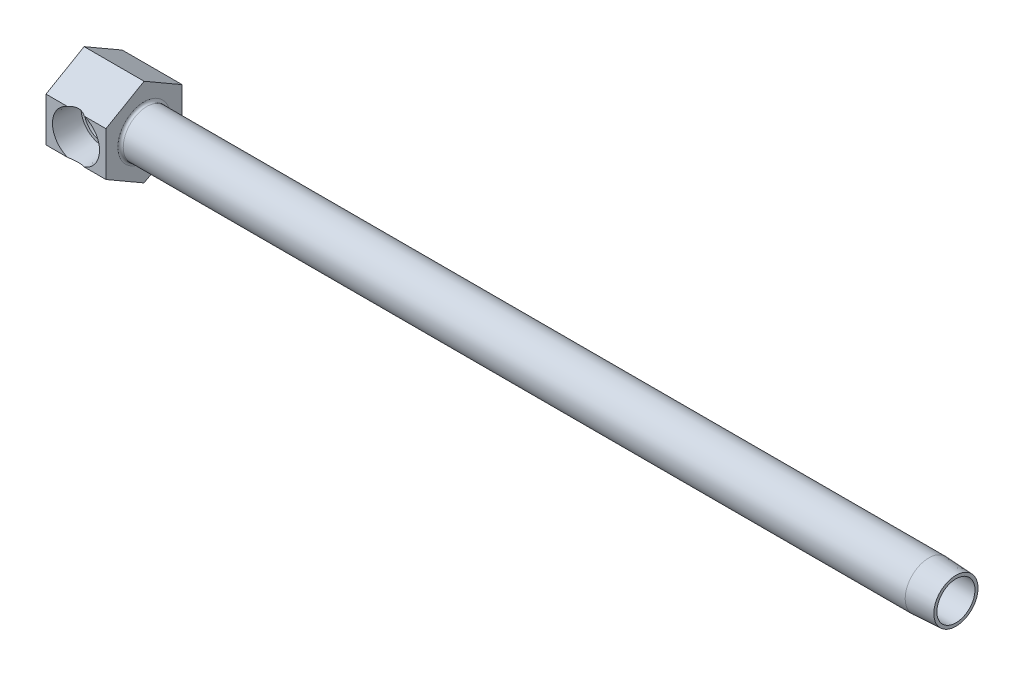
ISO-10303-21;
HEADER;
FILE_DESCRIPTION(('STEP AP214'),'2;1');
FILE_NAME('part.step','',(''),(''),'','','');
FILE_SCHEMA(('AUTOMOTIVE_DESIGN { 1 0 10303 214 1 1 1 1 }'));
ENDSEC;
DATA;
#1=APPLICATION_CONTEXT('core data for automotive mechanical design processes');
#2=APPLICATION_PROTOCOL_DEFINITION('international standard','automotive_design',2000,#1);
#3=PRODUCT_CONTEXT('',#1,'mechanical');
#4=PRODUCT('Part','Part','',(#3));
#5=PRODUCT_RELATED_PRODUCT_CATEGORY('part','',(#4));
#6=PRODUCT_DEFINITION_FORMATION('','',#4);
#7=PRODUCT_DEFINITION_CONTEXT('part definition',#1,'design');
#8=PRODUCT_DEFINITION('design','',#6,#7);
#9=PRODUCT_DEFINITION_SHAPE('','',#8);
#10=(LENGTH_UNIT() NAMED_UNIT(*) SI_UNIT(.MILLI.,.METRE.));
#11=(NAMED_UNIT(*) PLANE_ANGLE_UNIT() SI_UNIT($,.RADIAN.));
#12=(NAMED_UNIT(*) SI_UNIT($,.STERADIAN.) SOLID_ANGLE_UNIT());
#13=UNCERTAINTY_MEASURE_WITH_UNIT(LENGTH_MEASURE(1.E-05),#10,'distance_accuracy_value','');
#14=(GEOMETRIC_REPRESENTATION_CONTEXT(3) GLOBAL_UNCERTAINTY_ASSIGNED_CONTEXT((#13)) GLOBAL_UNIT_ASSIGNED_CONTEXT((#10,
#11,#12)) REPRESENTATION_CONTEXT('',''));
#15=CARTESIAN_POINT('',(0.,0.,0.));
#16=DIRECTION('',(0.,0.,1.));
#17=DIRECTION('',(1.,0.,0.));
#18=AXIS2_PLACEMENT_3D('',#15,#16,#17);
#19=CARTESIAN_POINT('',(8.7376,0.,22.225));
#20=DIRECTION('',(0.,0.,1.));
#21=DIRECTION('',(1.,0.,0.));
#22=AXIS2_PLACEMENT_3D('',#19,#20,#21);
#23=CONICAL_SURFACE('',#22,6.858,0.0523598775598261);
#24=CARTESIAN_POINT('',(8.7376,-0.680996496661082,34.5170205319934));
#25=DIRECTION('',(0.,-0.866025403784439,-0.5));
#26=DIRECTION('',(0.,-0.5,0.866025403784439));
#27=AXIS2_PLACEMENT_3D('',#24,#25,#26);
#28=ELLIPSE('',#27,15.0043949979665,7.47122554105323);
#29=CARTESIAN_POINT('',(11.1603281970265,6.4158048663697,22.225));
#30=VERTEX_POINT('',#29);
#31=CARTESIAN_POINT('',(6.3148718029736,6.4158048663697,22.225));
#32=VERTEX_POINT('',#31);
#33=EDGE_CURVE('E180',#30,#32,#28,.F.);
#34=ORIENTED_EDGE('',*,*,#33,.T.);
#35=CARTESIAN_POINT('',(8.7376,0.,22.225));
#36=DIRECTION('',(0.,0.,-1.));
#37=DIRECTION('',(-1.,0.,0.));
#38=AXIS2_PLACEMENT_3D('',#35,#36,#37);
#39=CIRCLE('',#38,6.858);
#40=CARTESIAN_POINT('',(6.31487180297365,-6.41580486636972,22.225));
#41=VERTEX_POINT('',#40);
#42=EDGE_CURVE('E38',#41,#32,#39,.T.);
#43=ORIENTED_EDGE('',*,*,#42,.F.);
#44=CARTESIAN_POINT('',(8.7376,0.680996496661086,34.5170205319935));
#45=DIRECTION('',(0.,0.866025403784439,-0.5));
#46=DIRECTION('',(0.,0.5,0.866025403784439));
#47=AXIS2_PLACEMENT_3D('',#44,#45,#46);
#48=ELLIPSE('',#47,15.0043949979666,7.47122554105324);
#49=CARTESIAN_POINT('',(11.1603281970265,-6.4158048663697,22.225));
#50=VERTEX_POINT('',#49);
#51=EDGE_CURVE('E23',#41,#50,#48,.F.);
#52=ORIENTED_EDGE('',*,*,#51,.T.);
#53=EDGE_CURVE('E174',#30,#50,#39,.T.);
#54=ORIENTED_EDGE('',*,*,#53,.F.);
#55=EDGE_LOOP('',(#34,#43,#52,#54));
#56=FACE_BOUND('',#55,.T.);
#57=CARTESIAN_POINT('',(8.7376,0.,14.3002));
#58=DIRECTION('',(0.,0.,-1.));
#59=DIRECTION('',(-1.,0.,0.));
#60=AXIS2_PLACEMENT_3D('',#57,#58,#59);
#61=CIRCLE('',#60,6.44267883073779);
#62=CARTESIAN_POINT('',(13.3057672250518,-4.54312213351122,14.3002));
#63=VERTEX_POINT('',#62);
#64=CARTESIAN_POINT('',(13.3057672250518,4.54312213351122,14.3002));
#65=VERTEX_POINT('',#64);
#66=EDGE_CURVE('E172',#63,#65,#61,.T.);
#67=ORIENTED_EDGE('',*,*,#66,.T.);
#68=CARTESIAN_POINT('',(13.3056128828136,4.54326245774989,14.3));
#69=CARTESIAN_POINT('',(13.4050037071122,4.45290836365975,14.4287190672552));
#70=CARTESIAN_POINT('',(13.5038252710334,4.35690222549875,14.5539811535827));
#71=CARTESIAN_POINT('',(13.6989301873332,4.15324987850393,14.7972290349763));
#72=CARTESIAN_POINT('',(13.7952093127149,4.04558563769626,14.9152031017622));
#73=CARTESIAN_POINT('',(13.9843700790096,3.81752411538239,15.1441485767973));
#74=CARTESIAN_POINT('',(14.0772125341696,3.69701926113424,15.25504596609));
#75=CARTESIAN_POINT('',(14.2568464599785,3.44414434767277,15.4675620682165));
#76=CARTESIAN_POINT('',(14.3436418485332,3.31178210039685,15.5691868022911));
#77=CARTESIAN_POINT('',(14.5527686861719,2.962976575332,15.8122617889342));
#78=CARTESIAN_POINT('',(14.6701286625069,2.73858307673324,15.9469651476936));
#79=CARTESIAN_POINT('',(14.8276174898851,2.38307262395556,16.1264780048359));
#80=CARTESIAN_POINT('',(14.8769849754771,2.26153631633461,16.1825173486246));
#81=CARTESIAN_POINT('',(14.9687772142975,2.0125151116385,16.2864098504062));
#82=CARTESIAN_POINT('',(15.0112056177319,1.88503338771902,16.3342673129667));
#83=CARTESIAN_POINT('',(15.088733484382,1.62324870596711,16.4215218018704));
#84=CARTESIAN_POINT('',(15.1237419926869,1.48888366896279,16.4608139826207));
#85=CARTESIAN_POINT('',(15.1849785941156,1.21573970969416,16.5294343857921));
#86=CARTESIAN_POINT('',(15.2112114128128,1.0769632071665,16.5587679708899));
#87=CARTESIAN_POINT('',(15.2542466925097,0.796159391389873,16.6068431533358));
#88=CARTESIAN_POINT('',(15.2710505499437,0.654132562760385,16.6255863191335));
#89=CARTESIAN_POINT('',(15.2947665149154,0.368243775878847,16.6520290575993));
#90=CARTESIAN_POINT('',(15.3016803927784,0.224382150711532,16.6597306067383));
#91=CARTESIAN_POINT('',(15.3051381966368,-0.0413792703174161,16.6635827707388));
#92=CARTESIAN_POINT('',(15.3031178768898,-0.163241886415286,16.6613326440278));
#93=CARTESIAN_POINT('',(15.2919140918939,-0.406265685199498,16.6488476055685));
#94=CARTESIAN_POINT('',(15.282728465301,-0.527426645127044,16.6386102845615));
#95=CARTESIAN_POINT('',(15.2573805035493,-0.768029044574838,16.6103343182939));
#96=CARTESIAN_POINT('',(15.2412218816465,-0.887471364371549,16.5922998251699));
#97=CARTESIAN_POINT('',(15.2022471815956,-1.1238947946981,16.5487418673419));
#98=CARTESIAN_POINT('',(15.1794285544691,-1.24087494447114,16.5232155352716));
#99=CARTESIAN_POINT('',(15.1030013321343,-1.58064044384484,16.4375716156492));
#100=CARTESIAN_POINT('',(15.0406598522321,-1.79907617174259,16.3675454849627));
#101=CARTESIAN_POINT('',(14.8959772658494,-2.2198653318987,16.2041288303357));
#102=CARTESIAN_POINT('',(14.8136249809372,-2.42220969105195,16.1107252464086));
#103=CARTESIAN_POINT('',(14.6581620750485,-2.75475802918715,15.9330467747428));
#104=CARTESIAN_POINT('',(14.588877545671,-2.88934500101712,15.8534887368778));
#105=CARTESIAN_POINT('',(14.4433958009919,-3.14876465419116,15.6853070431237));
#106=CARTESIAN_POINT('',(14.3671982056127,-3.27359679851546,15.5966828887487));
#107=CARTESIAN_POINT('',(14.2091096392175,-3.51355050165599,15.4112660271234));
#108=CARTESIAN_POINT('',(14.1272094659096,-3.62865566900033,15.3144600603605));
#109=CARTESIAN_POINT('',(13.9591121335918,-3.84892561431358,15.1136697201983));
#110=CARTESIAN_POINT('',(13.8729164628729,-3.95409379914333,15.0096878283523));
#111=CARTESIAN_POINT('',(13.7069469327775,-4.14374167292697,14.8068120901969));
#112=CARTESIAN_POINT('',(13.62749258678,-4.22922772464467,14.7085925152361));
#113=CARTESIAN_POINT('',(13.4673498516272,-4.39212627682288,14.5076746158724));
#114=CARTESIAN_POINT('',(13.386669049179,-4.46957495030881,14.4049995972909));
#115=CARTESIAN_POINT('',(13.3056128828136,-4.54326245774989,14.3));
#116=B_SPLINE_CURVE_WITH_KNOTS('',3,(#68,#69,#70,#71,#72,#73,#74,#75,#76,#77,#78,#79,#80,#81,
#82,#83,#84,#85,#86,#87,#88,#89,#90,#91,#92,#93,#94,#95,#96,#97,#98,#99,#100,#101,#102,#103,
#104,#105,#106,#107,#108,#109,#110,#111,#112,#113,#114,#115),.UNSPECIFIED.,.F.,.F.,(4,2,2,2,2,2,
2,2,2,2,2,2,2,2,2,2,2,2,2,2,2,2,2,4),(0.,0.558072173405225,1.11702021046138,1.68108674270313,
2.24478434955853,3.1014063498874,3.52893103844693,3.95623010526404,4.38849766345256,
4.82053207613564,5.25250248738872,5.68439556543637,6.04963287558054,6.41498039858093,
6.7801336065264,7.14542675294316,7.85550743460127,8.56598569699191,9.07835413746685,
9.59075076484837,10.1039943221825,10.6170612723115,11.0743952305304,11.5295724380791),.UNSPECIFIED.);
#117=EDGE_CURVE('E131',#65,#63,#116,.T.);
#118=ORIENTED_EDGE('',*,*,#117,.T.);
#119=EDGE_LOOP('',(#67,#118));
#120=FACE_BOUND('',#119,.T.);
#121=ADVANCED_FACE('F15',(#56,#120),#23,.F.);
#122=CARTESIAN_POINT('',(15.1802788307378,0.,14.3002));
#123=DIRECTION('',(0.,0.,1.));
#124=DIRECTION('',(1.,0.,0.));
#125=AXIS2_PLACEMENT_3D('',#122,#123,#124);
#126=PLANE('',#125);
#127=ORIENTED_EDGE('',*,*,#66,.F.);
#128=DIRECTION('',(1.,0.,0.));
#129=VECTOR('',#128,1.);
#130=CARTESIAN_POINT('',(65.6255637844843,-4.54312213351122,14.3002));
#131=LINE('',#130,#129);
#132=CARTESIAN_POINT('',(11.9253,-4.54312213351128,14.3002));
#133=VERTEX_POINT('',#132);
#134=EDGE_CURVE('E129',#63,#133,#131,.F.);
#135=ORIENTED_EDGE('',*,*,#134,.T.);
#136=CARTESIAN_POINT('',(8.7376,0.,14.3002));
#137=DIRECTION('',(0.,0.,-1.));
#138=DIRECTION('',(-1.,0.,0.));
#139=AXIS2_PLACEMENT_3D('',#136,#137,#138);
#140=CIRCLE('',#139,5.5499);
#141=CARTESIAN_POINT('',(11.9253,4.54312213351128,14.3002));
#142=VERTEX_POINT('',#141);
#143=EDGE_CURVE('E121',#133,#142,#140,.T.);
#144=ORIENTED_EDGE('',*,*,#143,.T.);
#145=DIRECTION('',(1.,0.,0.));
#146=VECTOR('',#145,1.);
#147=CARTESIAN_POINT('',(65.6255637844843,4.54312213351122,14.3002));
#148=LINE('',#147,#146);
#149=EDGE_CURVE('E124',#142,#65,#148,.T.);
#150=ORIENTED_EDGE('',*,*,#149,.T.);
#151=EDGE_LOOP('',(#127,#135,#144,#150));
#152=FACE_BOUND('',#151,.T.);
#153=ADVANCED_FACE('F162',(#152),#126,.T.);
#154=CARTESIAN_POINT('',(8.7376,0.,27.6280516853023));
#155=DIRECTION('',(0.,0.,-1.));
#156=DIRECTION('',(-1.,0.,0.));
#157=AXIS2_PLACEMENT_3D('',#154,#155,#156);
#158=CYLINDRICAL_SURFACE('',#157,5.5499);
#159=ORIENTED_EDGE('',*,*,#143,.F.);
#160=CARTESIAN_POINT('',(8.7376,0.,11.1125));
#161=DIRECTION('',(0.707106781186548,0.,-0.707106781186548));
#162=DIRECTION('',(-0.707106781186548,0.,-0.707106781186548));
#163=AXIS2_PLACEMENT_3D('',#160,#161,#162);
#164=ELLIPSE('',#163,7.84874384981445,5.5499);
#165=CARTESIAN_POINT('',(8.7376,-5.5499,11.1125));
#166=VERTEX_POINT('',#165);
#167=EDGE_CURVE('E110',#133,#166,#164,.T.);
#168=ORIENTED_EDGE('',*,*,#167,.T.);
#169=CARTESIAN_POINT('',(8.7376,0.,11.1125));
#170=DIRECTION('',(-0.707106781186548,0.,-0.707106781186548));
#171=DIRECTION('',(0.707106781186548,0.,-0.707106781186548));
#172=AXIS2_PLACEMENT_3D('',#169,#170,#171);
#173=ELLIPSE('',#172,7.84874384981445,5.5499);
#174=CARTESIAN_POINT('',(13.4708637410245,-2.89786203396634,6.37923625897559));
#175=VERTEX_POINT('',#174);
#176=EDGE_CURVE('E106',#166,#175,#173,.F.);
#177=ORIENTED_EDGE('',*,*,#176,.T.);
#178=CARTESIAN_POINT('',(8.7376,0.,6.37923625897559));
#179=DIRECTION('',(0.,0.,-1.));
#180=DIRECTION('',(-1.,0.,0.));
#181=AXIS2_PLACEMENT_3D('',#178,#179,#180);
#182=CIRCLE('',#181,5.5499);
#183=CARTESIAN_POINT('',(13.4708637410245,2.89786203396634,6.37923625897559));
#184=VERTEX_POINT('',#183);
#185=EDGE_CURVE('E177',#175,#184,#182,.T.);
#186=ORIENTED_EDGE('',*,*,#185,.T.);
#187=CARTESIAN_POINT('',(8.7376,5.5499,11.1125));
#188=VERTEX_POINT('',#187);
#189=EDGE_CURVE('E30',#184,#188,#173,.F.);
#190=ORIENTED_EDGE('',*,*,#189,.T.);
#191=EDGE_CURVE('E122',#188,#142,#164,.T.);
#192=ORIENTED_EDGE('',*,*,#191,.T.);
#193=EDGE_LOOP('',(#159,#168,#177,#186,#190,#192));
#194=FACE_BOUND('',#193,.T.);
#195=ADVANCED_FACE('F118',(#194),#158,.F.);
#196=CARTESIAN_POINT('',(8.7376,0.,6.37923625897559));
#197=DIRECTION('',(0.,0.,1.));
#198=DIRECTION('',(1.,0.,0.));
#199=AXIS2_PLACEMENT_3D('',#196,#197,#198);
#200=CONICAL_SURFACE('',#199,5.5499,1.04719755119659);
#201=CARTESIAN_POINT('',(8.7376,0.,3.175));
#202=VERTEX_POINT('',#201);
#203=VERTEX_LOOP('',#202);
#204=FACE_BOUND('',#203,.T.);
#205=ORIENTED_EDGE('',*,*,#185,.F.);
#206=CARTESIAN_POINT('',(13.4710699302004,-2.89818868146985,6.37943625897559));
#207=CARTESIAN_POINT('',(13.420685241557,-2.8185279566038,6.33063423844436));
#208=CARTESIAN_POINT('',(13.3737513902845,-2.73601453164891,6.28289768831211));
#209=CARTESIAN_POINT('',(13.2869939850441,-2.56583570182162,6.19038737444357));
#210=CARTESIAN_POINT('',(13.2471660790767,-2.47817349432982,6.14561180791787));
#211=CARTESIAN_POINT('',(13.1751547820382,-2.29911606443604,6.06025322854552));
#212=CARTESIAN_POINT('',(13.1428940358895,-2.20777091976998,6.01963042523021));
#213=CARTESIAN_POINT('',(13.0851463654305,-2.02119544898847,5.94274790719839));
#214=CARTESIAN_POINT('',(13.0596596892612,-1.92596498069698,5.90648835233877));
#215=CARTESIAN_POINT('',(13.0148514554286,-1.73255643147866,5.83897057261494));
#216=CARTESIAN_POINT('',(12.9955185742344,-1.63438413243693,5.80770321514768));
#217=CARTESIAN_POINT('',(12.9620830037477,-1.4356334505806,5.75050007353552));
#218=CARTESIAN_POINT('',(12.9479806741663,-1.33505490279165,5.72456465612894));
#219=CARTESIAN_POINT('',(12.9240526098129,-1.13183172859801,5.67823452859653));
#220=CARTESIAN_POINT('',(12.9142392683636,-1.02918199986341,5.65785593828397));
#221=CARTESIAN_POINT('',(12.8981074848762,-0.822623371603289,5.62290462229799));
#222=CARTESIAN_POINT('',(12.891789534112,-0.718714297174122,5.60833271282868));
#223=CARTESIAN_POINT('',(12.8810293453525,-0.489671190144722,5.58281999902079));
#224=CARTESIAN_POINT('',(12.8771967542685,-0.364365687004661,5.57314917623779));
#225=CARTESIAN_POINT('',(12.8729275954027,-0.113319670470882,5.56233429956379));
#226=CARTESIAN_POINT('',(12.8724915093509,0.0124209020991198,5.56119145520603));
#227=CARTESIAN_POINT('',(12.874939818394,0.263686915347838,5.567443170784));
#228=CARTESIAN_POINT('',(12.8778249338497,0.38921230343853,5.57483958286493));
#229=CARTESIAN_POINT('',(12.8874191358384,0.639322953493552,5.59811647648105));
#230=CARTESIAN_POINT('',(12.8941278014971,0.763908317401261,5.61399602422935));
#231=CARTESIAN_POINT('',(12.9116197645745,1.00072761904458,5.65236645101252));
#232=CARTESIAN_POINT('',(12.9220027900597,1.11310193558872,5.67417088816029));
#233=CARTESIAN_POINT('',(12.9479188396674,1.33574469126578,5.72453194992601));
#234=CARTESIAN_POINT('',(12.9634519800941,1.44601308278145,5.75308872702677));
#235=CARTESIAN_POINT('',(13.00082798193,1.66326683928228,5.81649299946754));
#236=CARTESIAN_POINT('',(13.022650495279,1.77026157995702,5.85132007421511));
#237=CARTESIAN_POINT('',(13.0737132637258,1.98033019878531,5.9267367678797));
#238=CARTESIAN_POINT('',(13.1029503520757,2.08340572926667,5.96732392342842));
#239=CARTESIAN_POINT('',(13.1785970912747,2.31167706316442,6.06504898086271));
#240=CARTESIAN_POINT('',(13.2275080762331,2.43541928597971,6.12371071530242));
#241=CARTESIAN_POINT('',(13.3111431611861,2.61414296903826,6.21635789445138));
#242=CARTESIAN_POINT('',(13.3408272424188,2.67271819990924,6.24810824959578));
#243=CARTESIAN_POINT('',(13.4034989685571,2.78735967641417,6.31288069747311));
#244=CARTESIAN_POINT('',(13.4364871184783,2.8434255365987,6.34590298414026));
#245=CARTESIAN_POINT('',(13.4710699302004,2.89818868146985,6.37943625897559));
#246=B_SPLINE_CURVE_WITH_KNOTS('',3,(#206,#207,#208,#209,#210,#211,#212,#213,#214,#215,#216,
#217,#218,#219,#220,#221,#222,#223,#224,#225,#226,#227,#228,#229,#230,#231,#232,#233,#234,#235,
#236,#237,#238,#239,#240,#241,#242,#243,#244,#245),.UNSPECIFIED.,.F.,.F.,(4,2,2,2,2,2,2,2,2,2,2,
2,2,2,2,2,2,2,2,4),(0.,0.318348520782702,0.636501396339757,0.951244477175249,1.26599908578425,
1.58017112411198,1.89436476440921,2.20946038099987,2.52460027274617,2.90145665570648,
3.27836648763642,3.65535808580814,4.03230819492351,4.37682355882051,4.72134670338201,
5.06476748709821,5.40804184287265,5.84309066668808,6.06180090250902,6.28054461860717),.UNSPECIFIED.);
#247=EDGE_CURVE('E112',#175,#184,#246,.T.);
#248=ORIENTED_EDGE('',*,*,#247,.T.);
#249=EDGE_LOOP('',(#205,#248));
#250=FACE_BOUND('',#249,.T.);
#251=ADVANCED_FACE('F155',(#204,#250),#200,.F.);
#252=CARTESIAN_POINT('',(254.,0.,11.1125));
#253=DIRECTION('',(-1.,0.,0.));
#254=DIRECTION('',(0.,0.,1.));
#255=AXIS2_PLACEMENT_3D('',#252,#253,#254);
#256=PLANE('',#255);
#257=CARTESIAN_POINT('',(254.,0.,11.1125));
#258=DIRECTION('',(-1.,0.,0.));
#259=DIRECTION('',(0.,0.,1.));
#260=AXIS2_PLACEMENT_3D('',#257,#258,#259);
#261=CIRCLE('',#260,6.44267883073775);
#262=CARTESIAN_POINT('',(254.,0.,17.5551788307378));
#263=VERTEX_POINT('',#262);
#264=EDGE_CURVE('E10',#263,#263,#261,.T.);
#265=ORIENTED_EDGE('',*,*,#264,.F.);
#266=EDGE_LOOP('',(#265));
#267=FACE_BOUND('',#266,.T.);
#268=CARTESIAN_POINT('',(254.,0.,11.1125));
#269=DIRECTION('',(1.,0.,0.));
#270=DIRECTION('',(0.,0.,-1.));
#271=AXIS2_PLACEMENT_3D('',#268,#269,#270);
#272=CIRCLE('',#271,5.5499);
#273=CARTESIAN_POINT('',(254.,0.,5.5626));
#274=VERTEX_POINT('',#273);
#275=EDGE_CURVE('E154',#274,#274,#272,.T.);
#276=ORIENTED_EDGE('',*,*,#275,.F.);
#277=EDGE_LOOP('',(#276));
#278=FACE_BOUND('',#277,.T.);
#279=ADVANCED_FACE('F159',(#267,#278),#256,.F.);
#280=CARTESIAN_POINT('',(254.,0.,11.1125));
#281=DIRECTION('',(-1.,0.,0.));
#282=DIRECTION('',(0.,0.,1.));
#283=AXIS2_PLACEMENT_3D('',#280,#281,#282);
#284=CYLINDRICAL_SURFACE('',#283,6.858);
#285=CARTESIAN_POINT('',(18.2499,0.,11.1125));
#286=DIRECTION('',(-1.,0.,0.));
#287=DIRECTION('',(0.,-1.,0.));
#288=AXIS2_PLACEMENT_3D('',#285,#286,#287);
#289=CIRCLE('',#288,6.858);
#290=CARTESIAN_POINT('',(18.2499,-6.858,11.1125));
#291=VERTEX_POINT('',#290);
#292=EDGE_CURVE('E239',#291,#291,#289,.F.);
#293=ORIENTED_EDGE('',*,*,#292,.T.);
#294=EDGE_LOOP('',(#293));
#295=FACE_BOUND('',#294,.T.);
#296=CARTESIAN_POINT('',(246.0752,0.,11.1125));
#297=DIRECTION('',(-1.,0.,0.));
#298=DIRECTION('',(0.,0.,1.));
#299=AXIS2_PLACEMENT_3D('',#296,#297,#298);
#300=CIRCLE('',#299,6.858);
#301=CARTESIAN_POINT('',(246.0752,0.,17.9705));
#302=VERTEX_POINT('',#301);
#303=EDGE_CURVE('E138',#302,#302,#300,.T.);
#304=ORIENTED_EDGE('',*,*,#303,.T.);
#305=EDGE_LOOP('',(#304));
#306=FACE_BOUND('',#305,.T.);
#307=ADVANCED_FACE('F289',(#295,#306),#284,.T.);
#308=CARTESIAN_POINT('',(17.4625,12.8316097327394,11.1125));
#309=DIRECTION('',(0.,-0.866025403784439,-0.5));
#310=DIRECTION('',(0.,0.5,-0.866025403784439));
#311=AXIS2_PLACEMENT_3D('',#308,#309,#310);
#312=PLANE('',#311);
#313=ORIENTED_EDGE('',*,*,#33,.F.);
#314=DIRECTION('',(-1.,0.,0.));
#315=VECTOR('',#314,1.);
#316=CARTESIAN_POINT('',(17.4625,6.4158048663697,22.225));
#317=LINE('',#316,#315);
#318=CARTESIAN_POINT('',(17.4625,6.4158048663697,22.225));
#319=VERTEX_POINT('',#318);
#320=EDGE_CURVE('E224',#319,#30,#317,.T.);
#321=ORIENTED_EDGE('',*,*,#320,.F.);
#322=DIRECTION('',(0.,-0.5,0.866025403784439));
#323=VECTOR('',#322,1.);
#324=CARTESIAN_POINT('',(17.4625,12.8316097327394,11.1125));
#325=LINE('',#324,#323);
#326=CARTESIAN_POINT('',(17.4625,12.8316097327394,11.1125));
#327=VERTEX_POINT('',#326);
#328=EDGE_CURVE('E208',#327,#319,#325,.T.);
#329=ORIENTED_EDGE('',*,*,#328,.F.);
#330=DIRECTION('',(-1.,0.,0.));
#331=VECTOR('',#330,1.);
#332=CARTESIAN_POINT('',(17.4625,12.8316097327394,11.1125));
#333=LINE('',#332,#331);
#334=CARTESIAN_POINT('',(0.,12.8316097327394,11.1125));
#335=VERTEX_POINT('',#334);
#336=EDGE_CURVE('E227',#327,#335,#333,.T.);
#337=ORIENTED_EDGE('',*,*,#336,.T.);
#338=DIRECTION('',(0.,-0.5,0.866025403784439));
#339=VECTOR('',#338,1.);
#340=CARTESIAN_POINT('',(0.,12.8316097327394,11.1125));
#341=LINE('',#340,#339);
#342=CARTESIAN_POINT('',(0.,6.4158048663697,22.225));
#343=VERTEX_POINT('',#342);
#344=EDGE_CURVE('E189',#335,#343,#341,.T.);
#345=ORIENTED_EDGE('',*,*,#344,.T.);
#346=EDGE_CURVE('E223',#32,#343,#317,.T.);
#347=ORIENTED_EDGE('',*,*,#346,.F.);
#348=EDGE_LOOP('',(#313,#321,#329,#337,#345,#347));
#349=FACE_BOUND('',#348,.T.);
#350=ADVANCED_FACE('F254',(#349),#312,.F.);
#351=CARTESIAN_POINT('',(17.4625,6.4158048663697,22.225));
#352=DIRECTION('',(0.,0.,-1.));
#353=DIRECTION('',(0.,1.,0.));
#354=AXIS2_PLACEMENT_3D('',#351,#352,#353);
#355=PLANE('',#354);
#356=ORIENTED_EDGE('',*,*,#42,.T.);
#357=ORIENTED_EDGE('',*,*,#346,.T.);
#358=DIRECTION('',(0.,-1.,0.));
#359=VECTOR('',#358,1.);
#360=CARTESIAN_POINT('',(0.,6.4158048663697,22.225));
#361=LINE('',#360,#359);
#362=CARTESIAN_POINT('',(0.,-6.41580486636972,22.225));
#363=VERTEX_POINT('',#362);
#364=EDGE_CURVE('E193',#343,#363,#361,.T.);
#365=ORIENTED_EDGE('',*,*,#364,.T.);
#366=DIRECTION('',(-1.,0.,0.));
#367=VECTOR('',#366,1.);
#368=CARTESIAN_POINT('',(17.4625,-6.41580486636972,22.225));
#369=LINE('',#368,#367);
#370=EDGE_CURVE('E219',#41,#363,#369,.T.);
#371=ORIENTED_EDGE('',*,*,#370,.F.);
#372=EDGE_LOOP('',(#356,#357,#365,#371));
#373=FACE_BOUND('',#372,.T.);
#374=ADVANCED_FACE('F257',(#373),#355,.F.);
#375=ORIENTED_EDGE('',*,*,#53,.T.);
#376=CARTESIAN_POINT('',(17.4625,-6.41580486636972,22.225));
#377=VERTEX_POINT('',#376);
#378=EDGE_CURVE('E220',#377,#50,#369,.T.);
#379=ORIENTED_EDGE('',*,*,#378,.F.);
#380=DIRECTION('',(0.,-1.,0.));
#381=VECTOR('',#380,1.);
#382=CARTESIAN_POINT('',(17.4625,6.4158048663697,22.225));
#383=LINE('',#382,#381);
#384=EDGE_CURVE('E210',#319,#377,#383,.T.);
#385=ORIENTED_EDGE('',*,*,#384,.F.);
#386=ORIENTED_EDGE('',*,*,#320,.T.);
#387=EDGE_LOOP('',(#375,#379,#385,#386));
#388=FACE_BOUND('',#387,.T.);
#389=ADVANCED_FACE('F250',(#388),#355,.F.);
#390=CARTESIAN_POINT('',(17.4625,-6.41580486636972,22.225));
#391=DIRECTION('',(0.,0.866025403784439,-0.5));
#392=DIRECTION('',(0.,0.5,0.866025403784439));
#393=AXIS2_PLACEMENT_3D('',#390,#391,#392);
#394=PLANE('',#393);
#395=ORIENTED_EDGE('',*,*,#51,.F.);
#396=ORIENTED_EDGE('',*,*,#370,.T.);
#397=DIRECTION('',(0.,-0.5,-0.866025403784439));
#398=VECTOR('',#397,1.);
#399=CARTESIAN_POINT('',(0.,-6.41580486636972,22.225));
#400=LINE('',#399,#398);
#401=CARTESIAN_POINT('',(0.,-12.8316097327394,11.1125));
#402=VERTEX_POINT('',#401);
#403=EDGE_CURVE('E197',#363,#402,#400,.T.);
#404=ORIENTED_EDGE('',*,*,#403,.T.);
#405=DIRECTION('',(-1.,0.,0.));
#406=VECTOR('',#405,1.);
#407=CARTESIAN_POINT('',(17.4625,-12.8316097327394,11.1125));
#408=LINE('',#407,#406);
#409=CARTESIAN_POINT('',(17.4625,-12.8316097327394,11.1125));
#410=VERTEX_POINT('',#409);
#411=EDGE_CURVE('E214',#410,#402,#408,.T.);
#412=ORIENTED_EDGE('',*,*,#411,.F.);
#413=DIRECTION('',(0.,-0.5,-0.866025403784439));
#414=VECTOR('',#413,1.);
#415=CARTESIAN_POINT('',(17.4625,-6.41580486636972,22.225));
#416=LINE('',#415,#414);
#417=EDGE_CURVE('E212',#377,#410,#416,.T.);
#418=ORIENTED_EDGE('',*,*,#417,.F.);
#419=ORIENTED_EDGE('',*,*,#378,.T.);
#420=EDGE_LOOP('',(#395,#396,#404,#412,#418,#419));
#421=FACE_BOUND('',#420,.T.);
#422=ADVANCED_FACE('F246',(#421),#394,.F.);
#423=CARTESIAN_POINT('',(17.4625,-12.8316097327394,11.1125));
#424=DIRECTION('',(0.,0.866025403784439,0.5));
#425=DIRECTION('',(0.,-0.5,0.866025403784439));
#426=AXIS2_PLACEMENT_3D('',#423,#424,#425);
#427=PLANE('',#426);
#428=DIRECTION('',(0.,0.5,-0.866025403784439));
#429=VECTOR('',#428,1.);
#430=CARTESIAN_POINT('',(0.,-12.8316097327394,11.1125));
#431=LINE('',#430,#429);
#432=CARTESIAN_POINT('',(0.,-6.41580486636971,0.));
#433=VERTEX_POINT('',#432);
#434=EDGE_CURVE('E182',#402,#433,#431,.T.);
#435=ORIENTED_EDGE('',*,*,#434,.T.);
#436=DIRECTION('',(-1.,0.,0.));
#437=VECTOR('',#436,1.);
#438=CARTESIAN_POINT('',(17.4625,-6.41580486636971,0.));
#439=LINE('',#438,#437);
#440=CARTESIAN_POINT('',(17.4625,-6.41580486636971,0.));
#441=VERTEX_POINT('',#440);
#442=EDGE_CURVE('E233',#441,#433,#439,.T.);
#443=ORIENTED_EDGE('',*,*,#442,.F.);
#444=DIRECTION('',(0.,0.5,-0.866025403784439));
#445=VECTOR('',#444,1.);
#446=CARTESIAN_POINT('',(17.4625,-12.8316097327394,11.1125));
#447=LINE('',#446,#445);
#448=EDGE_CURVE('E200',#410,#441,#447,.T.);
#449=ORIENTED_EDGE('',*,*,#448,.F.);
#450=ORIENTED_EDGE('',*,*,#411,.T.);
#451=EDGE_LOOP('',(#435,#443,#449,#450));
#452=FACE_BOUND('',#451,.T.);
#453=ADVANCED_FACE('F17',(#452),#427,.F.);
#454=CARTESIAN_POINT('',(17.4625,-6.41580486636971,0.));
#455=DIRECTION('',(0.,0.,1.));
#456=DIRECTION('',(1.,0.,0.));
#457=AXIS2_PLACEMENT_3D('',#454,#455,#456);
#458=PLANE('',#457);
#459=DIRECTION('',(0.,1.,0.));
#460=VECTOR('',#459,1.);
#461=CARTESIAN_POINT('',(0.,-6.41580486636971,0.));
#462=LINE('',#461,#460);
#463=CARTESIAN_POINT('',(0.,6.41580486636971,0.));
#464=VERTEX_POINT('',#463);
#465=EDGE_CURVE('E183',#433,#464,#462,.T.);
#466=ORIENTED_EDGE('',*,*,#465,.T.);
#467=DIRECTION('',(-1.,0.,0.));
#468=VECTOR('',#467,1.);
#469=CARTESIAN_POINT('',(17.4625,6.41580486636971,0.));
#470=LINE('',#469,#468);
#471=CARTESIAN_POINT('',(17.4625,6.41580486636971,0.));
#472=VERTEX_POINT('',#471);
#473=EDGE_CURVE('E230',#472,#464,#470,.T.);
#474=ORIENTED_EDGE('',*,*,#473,.F.);
#475=DIRECTION('',(0.,1.,0.));
#476=VECTOR('',#475,1.);
#477=CARTESIAN_POINT('',(17.4625,-6.41580486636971,0.));
#478=LINE('',#477,#476);
#479=EDGE_CURVE('E204',#441,#472,#478,.T.);
#480=ORIENTED_EDGE('',*,*,#479,.F.);
#481=ORIENTED_EDGE('',*,*,#442,.T.);
#482=EDGE_LOOP('',(#466,#474,#480,#481));
#483=FACE_BOUND('',#482,.T.);
#484=ADVANCED_FACE('F270',(#483),#458,.F.);
#485=CARTESIAN_POINT('',(17.4625,6.4158048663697,0.));
#486=DIRECTION('',(0.,-0.866025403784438,0.5));
#487=DIRECTION('',(0.,-0.5,-0.866025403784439));
#488=AXIS2_PLACEMENT_3D('',#485,#486,#487);
#489=PLANE('',#488);
#490=DIRECTION('',(0.,0.5,0.866025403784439));
#491=VECTOR('',#490,1.);
#492=CARTESIAN_POINT('',(0.,6.4158048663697,0.));
#493=LINE('',#492,#491);
#494=EDGE_CURVE('E186',#464,#335,#493,.T.);
#495=ORIENTED_EDGE('',*,*,#494,.T.);
#496=ORIENTED_EDGE('',*,*,#336,.F.);
#497=DIRECTION('',(0.,0.5,0.866025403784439));
#498=VECTOR('',#497,1.);
#499=CARTESIAN_POINT('',(17.4625,6.4158048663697,0.));
#500=LINE('',#499,#498);
#501=EDGE_CURVE('E206',#472,#327,#500,.T.);
#502=ORIENTED_EDGE('',*,*,#501,.F.);
#503=ORIENTED_EDGE('',*,*,#473,.T.);
#504=EDGE_LOOP('',(#495,#496,#502,#503));
#505=FACE_BOUND('',#504,.T.);
#506=ADVANCED_FACE('F276',(#505),#489,.F.);
#507=CARTESIAN_POINT('',(17.4625,-19.2474145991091,22.225));
#508=DIRECTION('',(-1.,0.,0.));
#509=DIRECTION('',(0.,-1.,0.));
#510=AXIS2_PLACEMENT_3D('',#507,#508,#509);
#511=PLANE('',#510);
#512=CARTESIAN_POINT('',(17.4625,0.,11.1125));
#513=DIRECTION('',(-1.,0.,0.));
#514=DIRECTION('',(0.,-1.,0.));
#515=AXIS2_PLACEMENT_3D('',#512,#513,#514);
#516=CIRCLE('',#515,7.6454);
#517=CARTESIAN_POINT('',(17.4625,-7.6454,11.1125));
#518=VERTEX_POINT('',#517);
#519=EDGE_CURVE('E236',#518,#518,#516,.T.);
#520=ORIENTED_EDGE('',*,*,#519,.T.);
#521=EDGE_LOOP('',(#520));
#522=FACE_BOUND('',#521,.T.);
#523=ORIENTED_EDGE('',*,*,#448,.T.);
#524=ORIENTED_EDGE('',*,*,#479,.T.);
#525=ORIENTED_EDGE('',*,*,#501,.T.);
#526=ORIENTED_EDGE('',*,*,#328,.T.);
#527=ORIENTED_EDGE('',*,*,#384,.T.);
#528=ORIENTED_EDGE('',*,*,#417,.T.);
#529=EDGE_LOOP('',(#523,#524,#525,#526,#527,#528));
#530=FACE_BOUND('',#529,.T.);
#531=ADVANCED_FACE('F273',(#522,#530),#511,.F.);
#532=CARTESIAN_POINT('',(0.,-19.2474145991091,22.225));
#533=DIRECTION('',(-1.,0.,0.));
#534=DIRECTION('',(0.,-1.,0.));
#535=AXIS2_PLACEMENT_3D('',#532,#533,#534);
#536=PLANE('',#535);
#537=ORIENTED_EDGE('',*,*,#434,.F.);
#538=ORIENTED_EDGE('',*,*,#403,.F.);
#539=ORIENTED_EDGE('',*,*,#364,.F.);
#540=ORIENTED_EDGE('',*,*,#344,.F.);
#541=ORIENTED_EDGE('',*,*,#494,.F.);
#542=ORIENTED_EDGE('',*,*,#465,.F.);
#543=EDGE_LOOP('',(#537,#538,#539,#540,#541,#542));
#544=FACE_BOUND('',#543,.T.);
#545=ADVANCED_FACE('F265',(#544),#536,.T.);
#546=CARTESIAN_POINT('',(18.2499,0.,11.1125));
#547=DIRECTION('',(-1.,0.,0.));
#548=DIRECTION('',(0.,-1.,0.));
#549=AXIS2_PLACEMENT_3D('',#546,#547,#548);
#550=TOROIDAL_SURFACE('',#549,7.6454,0.7874);
#551=ORIENTED_EDGE('',*,*,#292,.F.);
#552=EDGE_LOOP('',(#551));
#553=FACE_BOUND('',#552,.T.);
#554=ORIENTED_EDGE('',*,*,#519,.F.);
#555=EDGE_LOOP('',(#554));
#556=FACE_BOUND('',#555,.T.);
#557=ADVANCED_FACE('F296',(#553,#556),#550,.F.);
#558=CARTESIAN_POINT('',(64.0247389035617,0.,11.1125));
#559=DIRECTION('',(-1.,0.,0.));
#560=DIRECTION('',(0.,0.,1.));
#561=AXIS2_PLACEMENT_3D('',#558,#559,#560);
#562=CONICAL_SURFACE('',#561,16.398860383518,0.0523598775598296);
#563=ORIENTED_EDGE('',*,*,#264,.T.);
#564=EDGE_LOOP('',(#563));
#565=FACE_BOUND('',#564,.T.);
#566=ORIENTED_EDGE('',*,*,#303,.F.);
#567=EDGE_LOOP('',(#566));
#568=FACE_BOUND('',#567,.T.);
#569=ADVANCED_FACE('F146',(#565,#568),#562,.T.);
#570=CARTESIAN_POINT('',(65.6255637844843,0.,11.1125));
#571=DIRECTION('',(1.,0.,0.));
#572=DIRECTION('',(0.,0.,-1.));
#573=AXIS2_PLACEMENT_3D('',#570,#571,#572);
#574=CYLINDRICAL_SURFACE('',#573,5.5499);
#575=ORIENTED_EDGE('',*,*,#275,.T.);
#576=EDGE_LOOP('',(#575));
#577=FACE_BOUND('',#576,.T.);
#578=ORIENTED_EDGE('',*,*,#149,.F.);
#579=ORIENTED_EDGE('',*,*,#191,.F.);
#580=ORIENTED_EDGE('',*,*,#189,.F.);
#581=ORIENTED_EDGE('',*,*,#247,.F.);
#582=ORIENTED_EDGE('',*,*,#176,.F.);
#583=ORIENTED_EDGE('',*,*,#167,.F.);
#584=ORIENTED_EDGE('',*,*,#134,.F.);
#585=ORIENTED_EDGE('',*,*,#117,.F.);
#586=EDGE_LOOP('',(#578,#579,#580,#581,#582,#583,#584,#585));
#587=FACE_BOUND('',#586,.T.);
#588=ADVANCED_FACE('F108',(#577,#587),#574,.F.);
#589=CLOSED_SHELL('',(#121,#153,#195,#251,#279,#307,#350,#374,#389,#422,#453,#484,#506,#531,
#545,#557,#569,#588));
#590=MANIFOLD_SOLID_BREP('B1',#589);
#591=ADVANCED_BREP_SHAPE_REPRESENTATION('',(#18,#590),#14);
#592=SHAPE_DEFINITION_REPRESENTATION(#9,#591);
ENDSEC;
END-ISO-10303-21;
